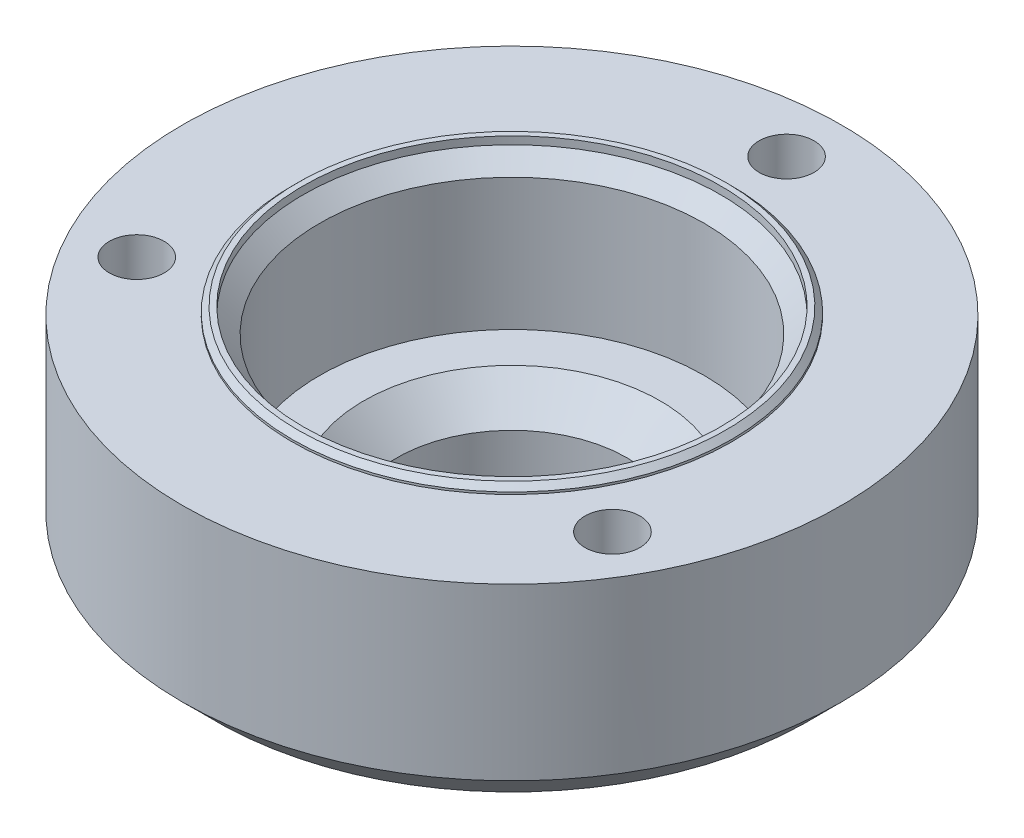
ISO-10303-21;
HEADER;
FILE_DESCRIPTION(('STEP AP214'),'2;1');
FILE_NAME('part.step','',(''),(''),'','','');
FILE_SCHEMA(('AUTOMOTIVE_DESIGN { 1 0 10303 214 1 1 1 1 }'));
ENDSEC;
DATA;
#1=APPLICATION_CONTEXT('core data for automotive mechanical design processes');
#2=APPLICATION_PROTOCOL_DEFINITION('international standard','automotive_design',2000,#1);
#3=PRODUCT_CONTEXT('',#1,'mechanical');
#4=PRODUCT('Part','Part','',(#3));
#5=PRODUCT_RELATED_PRODUCT_CATEGORY('part','',(#4));
#6=PRODUCT_DEFINITION_FORMATION('','',#4);
#7=PRODUCT_DEFINITION_CONTEXT('part definition',#1,'design');
#8=PRODUCT_DEFINITION('design','',#6,#7);
#9=PRODUCT_DEFINITION_SHAPE('','',#8);
#10=(LENGTH_UNIT() NAMED_UNIT(*) SI_UNIT(.MILLI.,.METRE.));
#11=(NAMED_UNIT(*) PLANE_ANGLE_UNIT() SI_UNIT($,.RADIAN.));
#12=(NAMED_UNIT(*) SI_UNIT($,.STERADIAN.) SOLID_ANGLE_UNIT());
#13=UNCERTAINTY_MEASURE_WITH_UNIT(LENGTH_MEASURE(1.E-05),#10,'distance_accuracy_value','');
#14=(GEOMETRIC_REPRESENTATION_CONTEXT(3) GLOBAL_UNCERTAINTY_ASSIGNED_CONTEXT((#13)) GLOBAL_UNIT_ASSIGNED_CONTEXT((#10,
#11,#12)) REPRESENTATION_CONTEXT('',''));
#15=CARTESIAN_POINT('',(0.,0.,0.));
#16=DIRECTION('',(0.,0.,1.));
#17=DIRECTION('',(1.,0.,0.));
#18=AXIS2_PLACEMENT_3D('',#15,#16,#17);
#19=CARTESIAN_POINT('',(0.,53.3796178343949,0.));
#20=DIRECTION('',(0.,1.,0.));
#21=DIRECTION('',(0.,0.,1.00000000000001));
#22=AXIS2_PLACEMENT_3D('',#19,#20,#21);
#23=PLANE('',#22);
#24=CARTESIAN_POINT('',(21.650635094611,53.3796178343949,12.5000000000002));
#25=DIRECTION('',(0.,1.,0.));
#26=DIRECTION('',(0.,0.,1.00000000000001));
#27=AXIS2_PLACEMENT_3D('',#24,#25,#26);
#28=CIRCLE('',#27,2.49999999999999);
#29=CARTESIAN_POINT('',(21.650635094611,53.3796178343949,15.0000000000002));
#30=VERTEX_POINT('',#29);
#31=EDGE_CURVE('E88',#30,#30,#28,.T.);
#32=ORIENTED_EDGE('',*,*,#31,.F.);
#33=EDGE_LOOP('',(#32));
#34=FACE_BOUND('',#33,.T.);
#35=CARTESIAN_POINT('',(-21.6506350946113,53.3796178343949,12.4999999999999));
#36=DIRECTION('',(0.,1.,0.));
#37=DIRECTION('',(0.,0.,1.00000000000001));
#38=AXIS2_PLACEMENT_3D('',#35,#36,#37);
#39=CIRCLE('',#38,2.49999999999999);
#40=CARTESIAN_POINT('',(-21.6506350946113,53.3796178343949,14.9999999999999));
#41=VERTEX_POINT('',#40);
#42=EDGE_CURVE('E76',#41,#41,#39,.T.);
#43=ORIENTED_EDGE('',*,*,#42,.F.);
#44=EDGE_LOOP('',(#43));
#45=FACE_BOUND('',#44,.T.);
#46=CARTESIAN_POINT('',(0.,53.3796178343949,0.));
#47=DIRECTION('',(0.,1.,0.));
#48=DIRECTION('',(0.,0.,1.00000000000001));
#49=AXIS2_PLACEMENT_3D('',#46,#47,#48);
#50=CIRCLE('',#49,30.);
#51=CARTESIAN_POINT('',(0.,53.3796178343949,30.0000000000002));
#52=VERTEX_POINT('',#51);
#53=EDGE_CURVE('E94',#52,#52,#50,.T.);
#54=ORIENTED_EDGE('',*,*,#53,.T.);
#55=EDGE_LOOP('',(#54));
#56=FACE_BOUND('',#55,.T.);
#57=CARTESIAN_POINT('',(0.,53.3796178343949,-25.0000000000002));
#58=DIRECTION('',(0.,1.,0.));
#59=DIRECTION('',(0.,0.,1.00000000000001));
#60=AXIS2_PLACEMENT_3D('',#57,#58,#59);
#61=CIRCLE('',#60,2.49999999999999);
#62=CARTESIAN_POINT('',(0.,53.3796178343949,-22.5000000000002));
#63=VERTEX_POINT('',#62);
#64=EDGE_CURVE('E75',#63,#63,#61,.T.);
#65=ORIENTED_EDGE('',*,*,#64,.F.);
#66=EDGE_LOOP('',(#65));
#67=FACE_BOUND('',#66,.T.);
#68=CARTESIAN_POINT('',(0.,53.3796178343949,0.));
#69=DIRECTION('',(0.,1.,0.));
#70=DIRECTION('',(1.00000000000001,0.,0.));
#71=AXIS2_PLACEMENT_3D('',#68,#69,#70);
#72=CIRCLE('',#71,20.);
#73=CARTESIAN_POINT('',(20.0000000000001,53.3796178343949,0.));
#74=VERTEX_POINT('',#73);
#75=EDGE_CURVE('E203',#74,#74,#72,.T.);
#76=ORIENTED_EDGE('',*,*,#75,.F.);
#77=EDGE_LOOP('',(#76));
#78=FACE_BOUND('',#77,.T.);
#79=ADVANCED_FACE('F47',(#34,#45,#56,#67,#78),#23,.T.);
#80=CARTESIAN_POINT('',(0.,0.,0.));
#81=DIRECTION('',(0.,-1.,0.));
#82=DIRECTION('',(0.,0.,-1.00000000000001));
#83=AXIS2_PLACEMENT_3D('',#80,#81,#82);
#84=CYLINDRICAL_SURFACE('',#83,17.5);
#85=CARTESIAN_POINT('',(0.,51.8796178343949,0.));
#86=DIRECTION('',(0.,1.,0.));
#87=DIRECTION('',(0.,0.,1.00000000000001));
#88=AXIS2_PLACEMENT_3D('',#85,#86,#87);
#89=CIRCLE('',#88,17.5);
#90=CARTESIAN_POINT('',(0.,51.8796178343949,17.5000000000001));
#91=VERTEX_POINT('',#90);
#92=EDGE_CURVE('E109',#91,#91,#89,.T.);
#93=ORIENTED_EDGE('',*,*,#92,.T.);
#94=EDGE_LOOP('',(#93));
#95=FACE_BOUND('',#94,.T.);
#96=CARTESIAN_POINT('',(0.,39.8796178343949,0.));
#97=DIRECTION('',(0.,-1.,0.));
#98=DIRECTION('',(0.,0.,-1.00000000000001));
#99=AXIS2_PLACEMENT_3D('',#96,#97,#98);
#100=CIRCLE('',#99,17.5);
#101=CARTESIAN_POINT('',(0.,39.8796178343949,-17.5000000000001));
#102=VERTEX_POINT('',#101);
#103=EDGE_CURVE('E100',#102,#102,#100,.T.);
#104=ORIENTED_EDGE('',*,*,#103,.T.);
#105=EDGE_LOOP('',(#104));
#106=FACE_BOUND('',#105,.T.);
#107=ADVANCED_FACE('F143',(#95,#106),#84,.F.);
#108=CARTESIAN_POINT('',(13.5000000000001,24.8796178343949,0.));
#109=DIRECTION('',(0.,1.,0.));
#110=DIRECTION('',(0.,0.,1.00000000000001));
#111=AXIS2_PLACEMENT_3D('',#108,#109,#110);
#112=PLANE('',#111);
#113=CARTESIAN_POINT('',(0.,24.8796178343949,0.));
#114=DIRECTION('',(0.,1.,0.));
#115=DIRECTION('',(0.,0.,1.00000000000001));
#116=AXIS2_PLACEMENT_3D('',#113,#114,#115);
#117=CIRCLE('',#116,11.75);
#118=CARTESIAN_POINT('',(0.,24.8796178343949,11.7500000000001));
#119=VERTEX_POINT('',#118);
#120=EDGE_CURVE('E103',#119,#119,#117,.F.);
#121=ORIENTED_EDGE('',*,*,#120,.T.);
#122=EDGE_LOOP('',(#121));
#123=FACE_BOUND('',#122,.T.);
#124=CARTESIAN_POINT('',(0.,24.8796178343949,0.));
#125=DIRECTION('',(0.,-1.,0.));
#126=DIRECTION('',(0.,0.,-1.00000000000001));
#127=AXIS2_PLACEMENT_3D('',#124,#125,#126);
#128=CIRCLE('',#127,10.5);
#129=CARTESIAN_POINT('',(0.,24.8796178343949,-10.5000000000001));
#130=VERTEX_POINT('',#129);
#131=EDGE_CURVE('E97',#130,#130,#128,.T.);
#132=ORIENTED_EDGE('',*,*,#131,.F.);
#133=EDGE_LOOP('',(#132));
#134=FACE_BOUND('',#133,.T.);
#135=ADVANCED_FACE('F149',(#123,#134),#112,.F.);
#136=CARTESIAN_POINT('',(0.,0.,0.));
#137=DIRECTION('',(0.,-1.,0.));
#138=DIRECTION('',(0.,0.,-1.00000000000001));
#139=AXIS2_PLACEMENT_3D('',#136,#137,#138);
#140=CYLINDRICAL_SURFACE('',#139,10.5);
#141=CARTESIAN_POINT('',(0.,36.8796178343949,0.));
#142=DIRECTION('',(0.,1.,0.));
#143=DIRECTION('',(0.,0.,1.00000000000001));
#144=AXIS2_PLACEMENT_3D('',#141,#142,#143);
#145=CIRCLE('',#144,10.5);
#146=CARTESIAN_POINT('',(0.,36.8796178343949,10.5000000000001));
#147=VERTEX_POINT('',#146);
#148=EDGE_CURVE('E118',#147,#147,#145,.T.);
#149=ORIENTED_EDGE('',*,*,#148,.T.);
#150=EDGE_LOOP('',(#149));
#151=FACE_BOUND('',#150,.T.);
#152=ORIENTED_EDGE('',*,*,#131,.T.);
#153=EDGE_LOOP('',(#152));
#154=FACE_BOUND('',#153,.T.);
#155=ADVANCED_FACE('F164',(#151,#154),#140,.F.);
#156=CARTESIAN_POINT('',(17.5000000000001,39.8796178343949,0.));
#157=DIRECTION('',(0.,1.,0.));
#158=DIRECTION('',(0.,0.,1.00000000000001));
#159=AXIS2_PLACEMENT_3D('',#156,#157,#158);
#160=PLANE('',#159);
#161=CARTESIAN_POINT('',(0.,39.8796178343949,0.));
#162=DIRECTION('',(0.,1.,0.));
#163=DIRECTION('',(0.,0.,1.00000000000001));
#164=AXIS2_PLACEMENT_3D('',#161,#162,#163);
#165=CIRCLE('',#164,13.5);
#166=CARTESIAN_POINT('',(0.,39.8796178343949,13.5000000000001));
#167=VERTEX_POINT('',#166);
#168=EDGE_CURVE('E115',#167,#167,#165,.F.);
#169=ORIENTED_EDGE('',*,*,#168,.T.);
#170=EDGE_LOOP('',(#169));
#171=FACE_BOUND('',#170,.T.);
#172=ORIENTED_EDGE('',*,*,#103,.F.);
#173=EDGE_LOOP('',(#172));
#174=FACE_BOUND('',#173,.T.);
#175=ADVANCED_FACE('F161',(#171,#174),#160,.T.);
#176=CARTESIAN_POINT('',(0.,-47.9731959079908,0.));
#177=DIRECTION('',(0.,1.,0.));
#178=DIRECTION('',(0.,0.,1.00000000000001));
#179=AXIS2_PLACEMENT_3D('',#176,#177,#178);
#180=CYLINDRICAL_SURFACE('',#179,30.);
#181=CARTESIAN_POINT('',(0.,37.8796178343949,0.));
#182=DIRECTION('',(0.,-1.,0.));
#183=DIRECTION('',(0.,0.,-1.00000000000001));
#184=AXIS2_PLACEMENT_3D('',#181,#182,#183);
#185=CIRCLE('',#184,30.);
#186=CARTESIAN_POINT('',(0.,37.8796178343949,-30.0000000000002));
#187=VERTEX_POINT('',#186);
#188=EDGE_CURVE('E124',#187,#187,#185,.F.);
#189=ORIENTED_EDGE('',*,*,#188,.T.);
#190=EDGE_LOOP('',(#189));
#191=FACE_BOUND('',#190,.T.);
#192=ORIENTED_EDGE('',*,*,#53,.F.);
#193=EDGE_LOOP('',(#192));
#194=FACE_BOUND('',#193,.T.);
#195=ADVANCED_FACE('F158',(#191,#194),#180,.T.);
#196=CARTESIAN_POINT('',(21.6506350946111,39.3796178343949,12.5000000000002));
#197=DIRECTION('',(0.,1.,0.));
#198=DIRECTION('',(0.,0.,1.00000000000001));
#199=AXIS2_PLACEMENT_3D('',#196,#197,#198);
#200=CONICAL_SURFACE('',#199,2.5,1.02974425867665);
#201=CARTESIAN_POINT('',(21.6506350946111,37.877466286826,12.5000000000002));
#202=VERTEX_POINT('',#201);
#203=VERTEX_LOOP('',#202);
#204=FACE_BOUND('',#203,.T.);
#205=CARTESIAN_POINT('',(21.6506350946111,39.3796178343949,12.5000000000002));
#206=DIRECTION('',(0.,1.,0.));
#207=DIRECTION('',(0.,0.,1.00000000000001));
#208=AXIS2_PLACEMENT_3D('',#205,#206,#207);
#209=CIRCLE('',#208,2.5);
#210=CARTESIAN_POINT('',(21.6506350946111,39.3796178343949,15.0000000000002));
#211=VERTEX_POINT('',#210);
#212=EDGE_CURVE('E91',#211,#211,#209,.T.);
#213=ORIENTED_EDGE('',*,*,#212,.T.);
#214=EDGE_LOOP('',(#213));
#215=FACE_BOUND('',#214,.T.);
#216=ADVANCED_FACE('F156',(#204,#215),#200,.F.);
#217=CARTESIAN_POINT('',(21.650635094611,53.3796178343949,12.5000000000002));
#218=DIRECTION('',(0.,1.,0.));
#219=DIRECTION('',(0.,0.,1.00000000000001));
#220=AXIS2_PLACEMENT_3D('',#217,#218,#219);
#221=CYLINDRICAL_SURFACE('',#220,2.49999999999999);
#222=ORIENTED_EDGE('',*,*,#212,.F.);
#223=EDGE_LOOP('',(#222));
#224=FACE_BOUND('',#223,.T.);
#225=ORIENTED_EDGE('',*,*,#31,.T.);
#226=EDGE_LOOP('',(#225));
#227=FACE_BOUND('',#226,.T.);
#228=ADVANCED_FACE('F236',(#224,#227),#221,.F.);
#229=CARTESIAN_POINT('',(0.,39.3796178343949,-25.0000000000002));
#230=DIRECTION('',(0.,1.,0.));
#231=DIRECTION('',(0.,0.,1.00000000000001));
#232=AXIS2_PLACEMENT_3D('',#229,#230,#231);
#233=CONICAL_SURFACE('',#232,2.5,1.02974425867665);
#234=CARTESIAN_POINT('',(0.,37.877466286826,-25.0000000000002));
#235=VERTEX_POINT('',#234);
#236=VERTEX_LOOP('',#235);
#237=FACE_BOUND('',#236,.T.);
#238=CARTESIAN_POINT('',(0.,39.3796178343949,-25.0000000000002));
#239=DIRECTION('',(0.,1.,0.));
#240=DIRECTION('',(0.,0.,1.00000000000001));
#241=AXIS2_PLACEMENT_3D('',#238,#239,#240);
#242=CIRCLE('',#241,2.5);
#243=CARTESIAN_POINT('',(0.,39.3796178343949,-22.5000000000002));
#244=VERTEX_POINT('',#243);
#245=EDGE_CURVE('E79',#244,#244,#242,.T.);
#246=ORIENTED_EDGE('',*,*,#245,.T.);
#247=EDGE_LOOP('',(#246));
#248=FACE_BOUND('',#247,.T.);
#249=ADVANCED_FACE('F233',(#237,#248),#233,.F.);
#250=CARTESIAN_POINT('',(0.,53.3796178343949,-25.0000000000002));
#251=DIRECTION('',(0.,1.,0.));
#252=DIRECTION('',(0.,0.,1.00000000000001));
#253=AXIS2_PLACEMENT_3D('',#250,#251,#252);
#254=CYLINDRICAL_SURFACE('',#253,2.49999999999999);
#255=ORIENTED_EDGE('',*,*,#245,.F.);
#256=EDGE_LOOP('',(#255));
#257=FACE_BOUND('',#256,.T.);
#258=ORIENTED_EDGE('',*,*,#64,.T.);
#259=EDGE_LOOP('',(#258));
#260=FACE_BOUND('',#259,.T.);
#261=ADVANCED_FACE('F69',(#257,#260),#254,.F.);
#262=CARTESIAN_POINT('',(-21.6506350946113,39.3796178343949,12.4999999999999));
#263=DIRECTION('',(0.,1.,0.));
#264=DIRECTION('',(0.,0.,1.00000000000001));
#265=AXIS2_PLACEMENT_3D('',#262,#263,#264);
#266=CONICAL_SURFACE('',#265,2.5,1.02974425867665);
#267=CARTESIAN_POINT('',(-21.6506350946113,37.877466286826,12.4999999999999));
#268=VERTEX_POINT('',#267);
#269=VERTEX_LOOP('',#268);
#270=FACE_BOUND('',#269,.T.);
#271=CARTESIAN_POINT('',(-21.6506350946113,39.3796178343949,12.4999999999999));
#272=DIRECTION('',(0.,1.,0.));
#273=DIRECTION('',(0.,0.,1.00000000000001));
#274=AXIS2_PLACEMENT_3D('',#271,#272,#273);
#275=CIRCLE('',#274,2.5);
#276=CARTESIAN_POINT('',(-21.6506350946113,39.3796178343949,14.9999999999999));
#277=VERTEX_POINT('',#276);
#278=EDGE_CURVE('E73',#277,#277,#275,.T.);
#279=ORIENTED_EDGE('',*,*,#278,.T.);
#280=EDGE_LOOP('',(#279));
#281=FACE_BOUND('',#280,.T.);
#282=ADVANCED_FACE('F65',(#270,#281),#266,.F.);
#283=CARTESIAN_POINT('',(-21.6506350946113,53.3796178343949,12.4999999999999));
#284=DIRECTION('',(0.,1.,0.));
#285=DIRECTION('',(0.,0.,1.00000000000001));
#286=AXIS2_PLACEMENT_3D('',#283,#284,#285);
#287=CYLINDRICAL_SURFACE('',#286,2.49999999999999);
#288=ORIENTED_EDGE('',*,*,#278,.F.);
#289=EDGE_LOOP('',(#288));
#290=FACE_BOUND('',#289,.T.);
#291=ORIENTED_EDGE('',*,*,#42,.T.);
#292=EDGE_LOOP('',(#291));
#293=FACE_BOUND('',#292,.T.);
#294=ADVANCED_FACE('F68',(#290,#293),#287,.F.);
#295=CARTESIAN_POINT('',(0.,122.580959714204,0.));
#296=DIRECTION('',(0.,-1.,0.));
#297=DIRECTION('',(0.,0.,-1.00000000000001));
#298=AXIS2_PLACEMENT_3D('',#295,#296,#297);
#299=CYLINDRICAL_SURFACE('',#298,12.75);
#300=CARTESIAN_POINT('',(0.,25.8796178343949,0.));
#301=DIRECTION('',(0.,1.,0.));
#302=DIRECTION('',(0.,0.,1.00000000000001));
#303=AXIS2_PLACEMENT_3D('',#300,#301,#302);
#304=CIRCLE('',#303,12.75);
#305=CARTESIAN_POINT('',(0.,25.8796178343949,12.7500000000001));
#306=VERTEX_POINT('',#305);
#307=EDGE_CURVE('E106',#306,#306,#304,.T.);
#308=ORIENTED_EDGE('',*,*,#307,.T.);
#309=EDGE_LOOP('',(#308));
#310=FACE_BOUND('',#309,.T.);
#311=CARTESIAN_POINT('',(0.,34.8796178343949,0.));
#312=DIRECTION('',(0.,-1.,0.));
#313=DIRECTION('',(0.,0.,-1.00000000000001));
#314=AXIS2_PLACEMENT_3D('',#311,#312,#313);
#315=CIRCLE('',#314,12.75);
#316=CARTESIAN_POINT('',(0.,34.8796178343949,-12.7500000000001));
#317=VERTEX_POINT('',#316);
#318=EDGE_CURVE('E82',#317,#317,#315,.T.);
#319=ORIENTED_EDGE('',*,*,#318,.T.);
#320=EDGE_LOOP('',(#319));
#321=FACE_BOUND('',#320,.T.);
#322=ADVANCED_FACE('F177',(#310,#321),#299,.T.);
#323=CARTESIAN_POINT('',(0.,24.8796178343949,0.));
#324=DIRECTION('',(0.,1.,0.));
#325=DIRECTION('',(0.,0.,1.00000000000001));
#326=AXIS2_PLACEMENT_3D('',#323,#324,#325);
#327=CONICAL_SURFACE('',#326,11.75,0.785398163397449);
#328=ORIENTED_EDGE('',*,*,#307,.F.);
#329=EDGE_LOOP('',(#328));
#330=FACE_BOUND('',#329,.T.);
#331=ORIENTED_EDGE('',*,*,#120,.F.);
#332=EDGE_LOOP('',(#331));
#333=FACE_BOUND('',#332,.T.);
#334=ADVANCED_FACE('F173',(#330,#333),#327,.T.);
#335=CARTESIAN_POINT('',(0.,51.8796178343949,0.));
#336=DIRECTION('',(0.,1.,0.));
#337=DIRECTION('',(0.,0.,1.00000000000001));
#338=AXIS2_PLACEMENT_3D('',#335,#336,#337);
#339=CONICAL_SURFACE('',#338,17.5,0.785398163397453);
#340=CARTESIAN_POINT('',(0.,53.3796178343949,0.));
#341=DIRECTION('',(0.,1.,0.));
#342=DIRECTION('',(0.,0.,1.00000000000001));
#343=AXIS2_PLACEMENT_3D('',#340,#341,#342);
#344=CIRCLE('',#343,19.);
#345=CARTESIAN_POINT('',(0.,53.3796178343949,19.0000000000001));
#346=VERTEX_POINT('',#345);
#347=EDGE_CURVE('E112',#346,#346,#344,.F.);
#348=ORIENTED_EDGE('',*,*,#347,.F.);
#349=EDGE_LOOP('',(#348));
#350=FACE_BOUND('',#349,.T.);
#351=ORIENTED_EDGE('',*,*,#92,.F.);
#352=EDGE_LOOP('',(#351));
#353=FACE_BOUND('',#352,.T.);
#354=ADVANCED_FACE('F176',(#350,#353),#339,.F.);
#355=CARTESIAN_POINT('',(0.,34.8796178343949,0.));
#356=DIRECTION('',(0.,-1.,0.));
#357=DIRECTION('',(0.,0.,-1.00000000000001));
#358=AXIS2_PLACEMENT_3D('',#355,#356,#357);
#359=PLANE('',#358);
#360=CARTESIAN_POINT('',(0.,34.8796178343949,0.));
#361=DIRECTION('',(0.,-1.,0.));
#362=DIRECTION('',(0.,0.,-1.00000000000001));
#363=AXIS2_PLACEMENT_3D('',#360,#361,#362);
#364=CIRCLE('',#363,27.);
#365=CARTESIAN_POINT('',(0.,34.8796178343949,-27.0000000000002));
#366=VERTEX_POINT('',#365);
#367=EDGE_CURVE('E121',#366,#366,#364,.T.);
#368=ORIENTED_EDGE('',*,*,#367,.T.);
#369=EDGE_LOOP('',(#368));
#370=FACE_BOUND('',#369,.T.);
#371=ORIENTED_EDGE('',*,*,#318,.F.);
#372=EDGE_LOOP('',(#371));
#373=FACE_BOUND('',#372,.T.);
#374=ADVANCED_FACE('F181',(#370,#373),#359,.T.);
#375=CARTESIAN_POINT('',(0.,39.8796178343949,0.));
#376=DIRECTION('',(0.,1.,0.));
#377=DIRECTION('',(0.,0.,1.00000000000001));
#378=AXIS2_PLACEMENT_3D('',#375,#376,#377);
#379=CONICAL_SURFACE('',#378,13.5,0.785398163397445);
#380=ORIENTED_EDGE('',*,*,#148,.F.);
#381=EDGE_LOOP('',(#380));
#382=FACE_BOUND('',#381,.T.);
#383=ORIENTED_EDGE('',*,*,#168,.F.);
#384=EDGE_LOOP('',(#383));
#385=FACE_BOUND('',#384,.T.);
#386=ADVANCED_FACE('F183',(#382,#385),#379,.F.);
#387=CARTESIAN_POINT('',(0.,34.8796178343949,0.));
#388=DIRECTION('',(0.,1.,0.));
#389=DIRECTION('',(0.,0.,1.00000000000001));
#390=AXIS2_PLACEMENT_3D('',#387,#388,#389);
#391=CONICAL_SURFACE('',#390,27.,0.785398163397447);
#392=ORIENTED_EDGE('',*,*,#188,.F.);
#393=EDGE_LOOP('',(#392));
#394=FACE_BOUND('',#393,.T.);
#395=ORIENTED_EDGE('',*,*,#367,.F.);
#396=EDGE_LOOP('',(#395));
#397=FACE_BOUND('',#396,.T.);
#398=ADVANCED_FACE('F185',(#394,#397),#391,.T.);
#399=CARTESIAN_POINT('',(0.,54.0796178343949,0.));
#400=DIRECTION('',(0.,1.,0.));
#401=DIRECTION('',(0.,0.,1.00000000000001));
#402=AXIS2_PLACEMENT_3D('',#399,#400,#401);
#403=PLANE('',#402);
#404=CARTESIAN_POINT('',(0.,54.0796178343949,0.));
#405=DIRECTION('',(0.,1.,0.));
#406=DIRECTION('',(0.,0.,1.00000000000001));
#407=AXIS2_PLACEMENT_3D('',#404,#405,#406);
#408=CIRCLE('',#407,19.5);
#409=CARTESIAN_POINT('',(0.,54.0796178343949,19.5000000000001));
#410=VERTEX_POINT('',#409);
#411=EDGE_CURVE('E55',#410,#410,#408,.T.);
#412=ORIENTED_EDGE('',*,*,#411,.T.);
#413=EDGE_LOOP('',(#412));
#414=FACE_BOUND('',#413,.T.);
#415=CARTESIAN_POINT('',(0.,54.0796178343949,0.));
#416=DIRECTION('',(0.,1.,0.));
#417=DIRECTION('',(0.,0.,1.00000000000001));
#418=AXIS2_PLACEMENT_3D('',#415,#416,#417);
#419=CIRCLE('',#418,19.);
#420=CARTESIAN_POINT('',(0.,54.0796178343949,19.0000000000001));
#421=VERTEX_POINT('',#420);
#422=EDGE_CURVE('E205',#421,#421,#419,.T.);
#423=ORIENTED_EDGE('',*,*,#422,.F.);
#424=EDGE_LOOP('',(#423));
#425=FACE_BOUND('',#424,.T.);
#426=ADVANCED_FACE('F129',(#414,#425),#403,.T.);
#427=CARTESIAN_POINT('',(0.,54.0796178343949,0.));
#428=DIRECTION('',(0.,-1.,0.));
#429=DIRECTION('',(0.,0.,-1.00000000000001));
#430=AXIS2_PLACEMENT_3D('',#427,#428,#429);
#431=CYLINDRICAL_SURFACE('',#430,20.);
#432=CARTESIAN_POINT('',(0.,53.5796178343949,0.));
#433=DIRECTION('',(0.,1.,0.));
#434=DIRECTION('',(0.,0.,1.00000000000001));
#435=AXIS2_PLACEMENT_3D('',#432,#433,#434);
#436=CIRCLE('',#435,20.);
#437=CARTESIAN_POINT('',(0.,53.5796178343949,20.0000000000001));
#438=VERTEX_POINT('',#437);
#439=EDGE_CURVE('E13',#438,#438,#436,.F.);
#440=ORIENTED_EDGE('',*,*,#439,.T.);
#441=EDGE_LOOP('',(#440));
#442=FACE_BOUND('',#441,.T.);
#443=ORIENTED_EDGE('',*,*,#75,.T.);
#444=EDGE_LOOP('',(#443));
#445=FACE_BOUND('',#444,.T.);
#446=ADVANCED_FACE('F138',(#442,#445),#431,.T.);
#447=CARTESIAN_POINT('',(0.,54.0796178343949,0.));
#448=DIRECTION('',(0.,-1.,0.));
#449=DIRECTION('',(0.,0.,-1.00000000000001));
#450=AXIS2_PLACEMENT_3D('',#447,#448,#449);
#451=CYLINDRICAL_SURFACE('',#450,19.);
#452=ORIENTED_EDGE('',*,*,#422,.T.);
#453=EDGE_LOOP('',(#452));
#454=FACE_BOUND('',#453,.T.);
#455=ORIENTED_EDGE('',*,*,#347,.T.);
#456=EDGE_LOOP('',(#455));
#457=FACE_BOUND('',#456,.T.);
#458=ADVANCED_FACE('F133',(#454,#457),#451,.F.);
#459=CARTESIAN_POINT('',(0.,54.0796178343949,0.));
#460=DIRECTION('',(0.,-1.,0.));
#461=DIRECTION('',(0.,0.,-1.00000000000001));
#462=AXIS2_PLACEMENT_3D('',#459,#460,#461);
#463=CONICAL_SURFACE('',#462,19.5,0.785398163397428);
#464=ORIENTED_EDGE('',*,*,#439,.F.);
#465=EDGE_LOOP('',(#464));
#466=FACE_BOUND('',#465,.T.);
#467=ORIENTED_EDGE('',*,*,#411,.F.);
#468=EDGE_LOOP('',(#467));
#469=FACE_BOUND('',#468,.T.);
#470=ADVANCED_FACE('F49',(#466,#469),#463,.T.);
#471=CLOSED_SHELL('',(#79,#107,#135,#155,#175,#195,#216,#228,#249,#261,#282,#294,#322,#334,#354,
#374,#386,#398,#426,#446,#458,#470));
#472=MANIFOLD_SOLID_BREP('B2',#471);
#473=ADVANCED_BREP_SHAPE_REPRESENTATION('',(#18,#472),#14);
#474=SHAPE_DEFINITION_REPRESENTATION(#9,#473);
ENDSEC;
END-ISO-10303-21;
